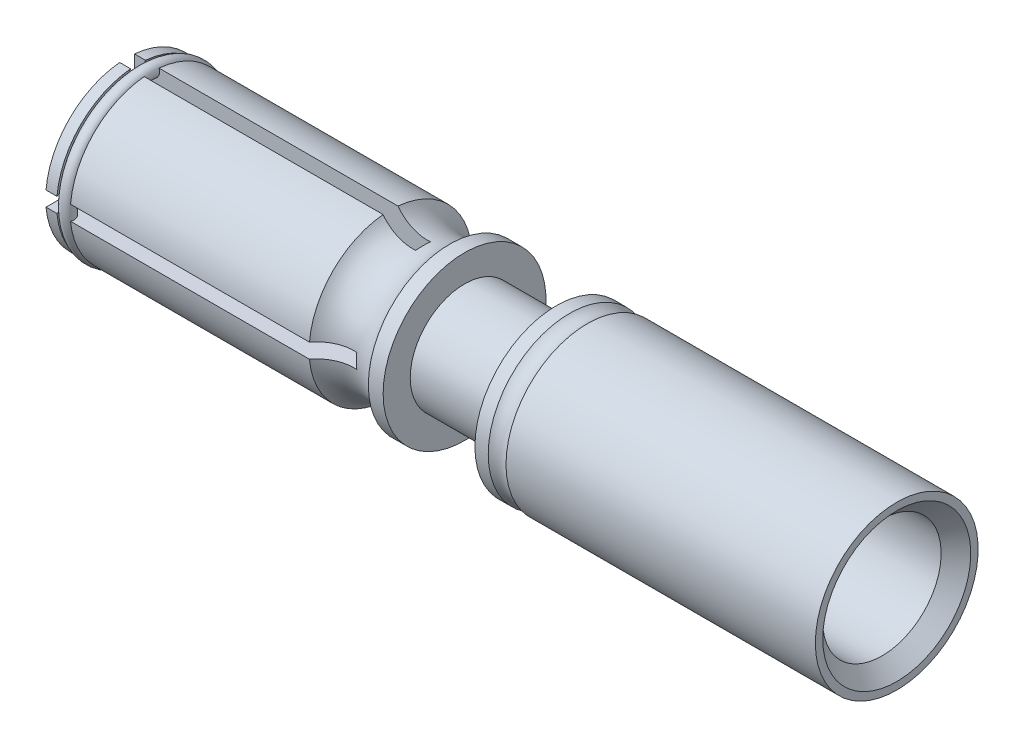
from build123d import *

# Parameters (mm, degrees)
ENL_V_MAT_EXTRU_1_DEPTH = 20
ESQUISSE3_R             = 0.45
BOSS_R_VOL_1_ANGLE      = 350


with BuildPart() as part:
    # Esquisse1 → Base-R_volution (revolve)
    with BuildSketch(Plane.XY, mode=Mode.PRIVATE) as base_r_volution_sk:
        with BuildLine():
            Line((-32, 5.5), (-31.258257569, 5.5))
            ThreePointArc((-31.258257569, 5.5), (-30.8, 4.8), (-30.341742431, 5.5))
            Line((-30.341742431, 5.5), (-14.2, 5.5))
            ThreePointArc((-14.2, 5.5), (-12.2, 4.5), (-10.2, 5.5))
            Line((-10.2, 5.5), (-9.2, 5.5))
            Line((-9.2, 5.5), (-9.2, 3.67))
            Line((-9.2, 3.67), (-3, 3.67))
            Line((-3, 3.67), (-3, 5.5))
            Line((-3, 5.5), (-2.1, 5.5))
            ThreePointArc((-2.1, 5.5), (-1.5, 5.3), (-0.9, 5.5))
            Line((-0.9, 5.5), (20, 5.5))
            Line((20, 5.5), (20, 5))
            Line((20, 5), (19, 4))
            Line((19, 4), (0, 4))
            Line((0, 4), (-1, 0))
            Line((-1, 0), (-10, 0))
            Line((-10, 0), (-11, 3))
            Line((-11, 3), (-31, 3))
            Line((-31, 3), (-32, 4))
            Line((-32, 4), (-32, 5.5))
        make_face()
    revolve(base_r_volution_sk.sketch.rotate(Axis((-58, 0, 0), (1, 0, 0)), 90), axis=Axis((-58, 0, 0), (1, 0, 0)))

    # Esquisse2 → Enl_v. mat.-Extru.1 (cut)
    with BuildSketch(Plane.ZY.offset(32)):
        Polygon((0.5, 0.5), (7.5, 0.5), (7.5, -0.5), (0.5, -0.5), (0.5, -6), (-0.5, -6), (-0.5, -0.5), (-6.5, -0.5), (-6.5, 0.5), (-0.5, 0.5), (-0.5, 6), (0.5, 6), align=None)
    extrude(amount=-ENL_V_MAT_EXTRU_1_DEPTH, mode=Mode.SUBTRACT)

    # Esquisse3 → Boss.-R_vol.1 (revolve)
    with BuildSketch(Plane(origin=(0, 0, 0), x_dir=(1, 0, 0), z_dir=(0, 1, 0))):
        with Locations((-30.8, 5.2)):
            Circle(ESQUISSE3_R)
    revolve(axis=Axis((-33, 0, 0), (1, 0, 0)), revolution_arc=BOSS_R_VOL_1_ANGLE)


solid = part.part
